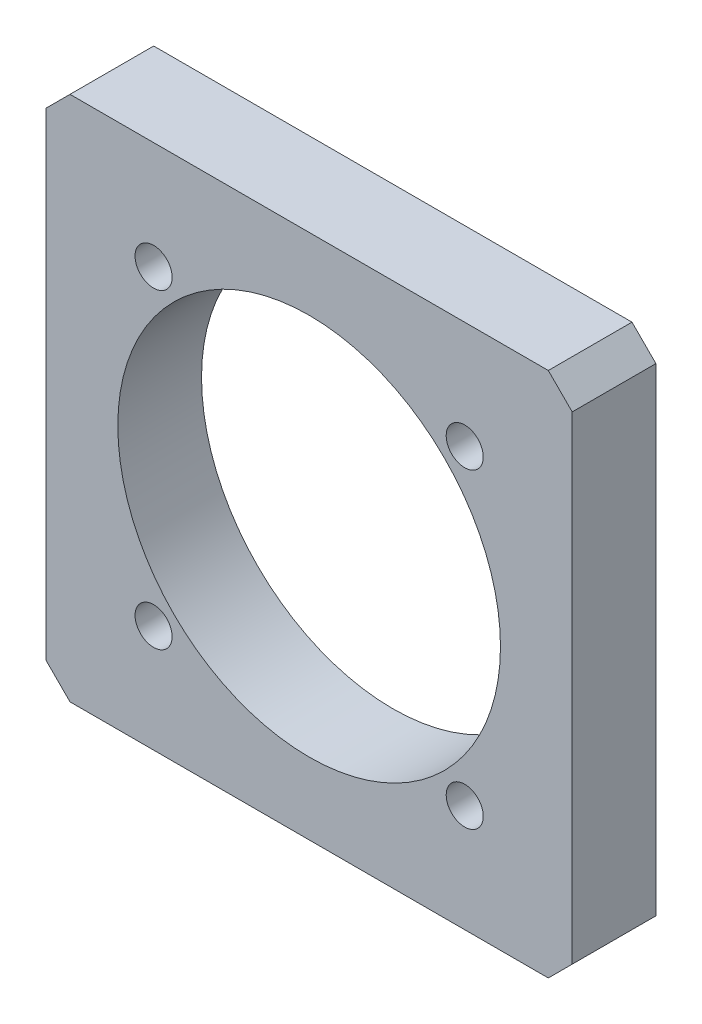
from build123d import *

# Parameters (mm, degrees)
ESQUISSE1_W        = 220
ESQUISSE1_H        = 220
ESQUISSE1_R        = 80
BOSS_EXTRU_1_DEPTH = 35
TROU_TARAUD_M181_D = 15.5
CHANFREIN1_SIZE    = 10


with BuildPart() as part:
    # Esquisse1 → Boss.-Extru.1 (new body)
    with BuildSketch(Plane.XY):
        Rectangle(ESQUISSE1_W, ESQUISSE1_H)
        Circle(ESQUISSE1_R, mode=Mode.SUBTRACT)
    extrude(amount=BOSS_EXTRU_1_DEPTH)

    # Trou taraud_ M181 (through all)
    with Locations(Plane(origin=(0, 0, 0), x_dir=(-1, 0, 0), z_dir=(0, 0, -1))):
        with Locations((65.053823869, 65.053823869), (-65.053823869, 65.053823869), (-65.053823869, -65.053823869), (65.053823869, -65.053823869)):
            Hole(TROU_TARAUD_M181_D / 2)

    # Chanfrein1
    chanfrein1_edges = [part.edges().sort_by_distance(p)[0] for p in [
        (-110, 110, 17.5),
        (110, 110, 17.5),
        (110, -110, 17.5),
        (-110, -110, 17.5),
    ]]
    chamfer(chanfrein1_edges, length=CHANFREIN1_SIZE)


solid = part.part
